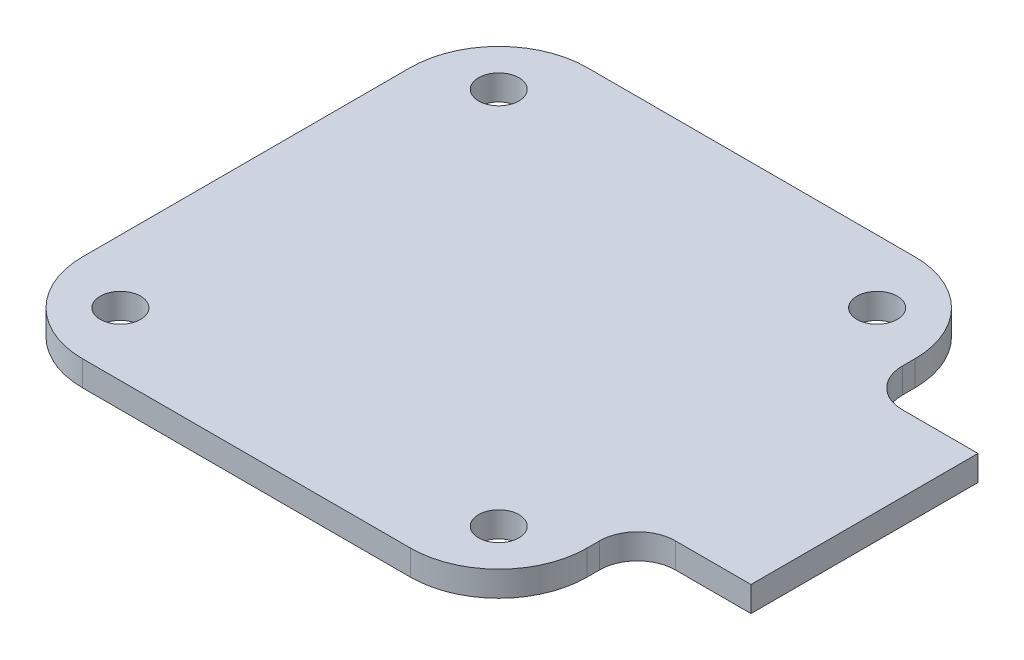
ISO-10303-21;
HEADER;
FILE_DESCRIPTION(('STEP AP214'),'2;1');
FILE_NAME('part.step','',(''),(''),'','','');
FILE_SCHEMA(('AUTOMOTIVE_DESIGN { 1 0 10303 214 1 1 1 1 }'));
ENDSEC;
DATA;
#1=APPLICATION_CONTEXT('core data for automotive mechanical design processes');
#2=APPLICATION_PROTOCOL_DEFINITION('international standard','automotive_design',2000,#1);
#3=PRODUCT_CONTEXT('',#1,'mechanical');
#4=PRODUCT('Part','Part','',(#3));
#5=PRODUCT_RELATED_PRODUCT_CATEGORY('part','',(#4));
#6=PRODUCT_DEFINITION_FORMATION('','',#4);
#7=PRODUCT_DEFINITION_CONTEXT('part definition',#1,'design');
#8=PRODUCT_DEFINITION('design','',#6,#7);
#9=PRODUCT_DEFINITION_SHAPE('','',#8);
#10=(LENGTH_UNIT() NAMED_UNIT(*) SI_UNIT(.MILLI.,.METRE.));
#11=(NAMED_UNIT(*) PLANE_ANGLE_UNIT() SI_UNIT($,.RADIAN.));
#12=(NAMED_UNIT(*) SI_UNIT($,.STERADIAN.) SOLID_ANGLE_UNIT());
#13=UNCERTAINTY_MEASURE_WITH_UNIT(LENGTH_MEASURE(1.E-05),#10,'distance_accuracy_value','');
#14=(GEOMETRIC_REPRESENTATION_CONTEXT(3) GLOBAL_UNCERTAINTY_ASSIGNED_CONTEXT((#13)) GLOBAL_UNIT_ASSIGNED_CONTEXT((#10,
#11,#12)) REPRESENTATION_CONTEXT('',''));
#15=CARTESIAN_POINT('',(0.,0.,0.));
#16=DIRECTION('',(0.,0.,1.));
#17=DIRECTION('',(1.,0.,0.));
#18=AXIS2_PLACEMENT_3D('',#15,#16,#17);
#19=CARTESIAN_POINT('',(-17.3708117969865,2.,-12.6206309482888));
#20=DIRECTION('',(0.,-1.,0.));
#21=DIRECTION('',(0.,0.,-1.));
#22=AXIS2_PLACEMENT_3D('',#19,#20,#21);
#23=CYLINDRICAL_SURFACE('',#22,7.);
#24=CARTESIAN_POINT('',(-17.3708117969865,0.,-12.6206309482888));
#25=DIRECTION('',(0.,1.,0.));
#26=DIRECTION('',(0.,0.,1.));
#27=AXIS2_PLACEMENT_3D('',#24,#25,#26);
#28=CIRCLE('',#27,7.);
#29=CARTESIAN_POINT('',(-17.3708117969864,0.,-19.6206309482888));
#30=VERTEX_POINT('',#29);
#31=CARTESIAN_POINT('',(-24.3708117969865,0.,-12.6206309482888));
#32=VERTEX_POINT('',#31);
#33=EDGE_CURVE('E170',#30,#32,#28,.T.);
#34=ORIENTED_EDGE('',*,*,#33,.T.);
#35=DIRECTION('',(0.,-1.,0.));
#36=VECTOR('',#35,1.);
#37=CARTESIAN_POINT('',(-24.3708117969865,2.,-12.6206309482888));
#38=LINE('',#37,#36);
#39=CARTESIAN_POINT('',(-24.3708117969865,2.,-12.6206309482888));
#40=VERTEX_POINT('',#39);
#41=EDGE_CURVE('E11',#40,#32,#38,.T.);
#42=ORIENTED_EDGE('',*,*,#41,.F.);
#43=CARTESIAN_POINT('',(-17.3708117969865,2.,-12.6206309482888));
#44=DIRECTION('',(0.,1.,0.));
#45=DIRECTION('',(0.,0.,1.));
#46=AXIS2_PLACEMENT_3D('',#43,#44,#45);
#47=CIRCLE('',#46,7.);
#48=CARTESIAN_POINT('',(-17.3708117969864,2.,-19.6206309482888));
#49=VERTEX_POINT('',#48);
#50=EDGE_CURVE('E197',#49,#40,#47,.T.);
#51=ORIENTED_EDGE('',*,*,#50,.F.);
#52=DIRECTION('',(0.,-1.,0.));
#53=VECTOR('',#52,1.);
#54=CARTESIAN_POINT('',(-17.3708117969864,2.,-19.6206309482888));
#55=LINE('',#54,#53);
#56=EDGE_CURVE('E166',#49,#30,#55,.T.);
#57=ORIENTED_EDGE('',*,*,#56,.T.);
#58=EDGE_LOOP('',(#34,#42,#51,#57));
#59=FACE_BOUND('',#58,.T.);
#60=ADVANCED_FACE('F38',(#59),#23,.T.);
#61=CARTESIAN_POINT('',(-24.3708117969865,2.,-12.6206309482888));
#62=DIRECTION('',(1.,0.,0.));
#63=DIRECTION('',(0.,0.,-1.));
#64=AXIS2_PLACEMENT_3D('',#61,#62,#63);
#65=PLANE('',#64);
#66=DIRECTION('',(0.,0.,1.));
#67=VECTOR('',#66,1.);
#68=CARTESIAN_POINT('',(-24.3708117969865,0.,-12.6206309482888));
#69=LINE('',#68,#67);
#70=CARTESIAN_POINT('',(-24.3708117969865,0.,13.3793690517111));
#71=VERTEX_POINT('',#70);
#72=EDGE_CURVE('E173',#32,#71,#69,.T.);
#73=ORIENTED_EDGE('',*,*,#72,.T.);
#74=DIRECTION('',(0.,-1.,0.));
#75=VECTOR('',#74,1.);
#76=CARTESIAN_POINT('',(-24.3708117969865,2.,13.3793690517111));
#77=LINE('',#76,#75);
#78=CARTESIAN_POINT('',(-24.3708117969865,2.,13.3793690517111));
#79=VERTEX_POINT('',#78);
#80=EDGE_CURVE('E46',#79,#71,#77,.T.);
#81=ORIENTED_EDGE('',*,*,#80,.F.);
#82=DIRECTION('',(0.,0.,1.));
#83=VECTOR('',#82,1.);
#84=CARTESIAN_POINT('',(-24.3708117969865,2.,-12.6206309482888));
#85=LINE('',#84,#83);
#86=EDGE_CURVE('E115',#40,#79,#85,.T.);
#87=ORIENTED_EDGE('',*,*,#86,.F.);
#88=ORIENTED_EDGE('',*,*,#41,.T.);
#89=EDGE_LOOP('',(#73,#81,#87,#88));
#90=FACE_BOUND('',#89,.T.);
#91=ADVANCED_FACE('F286',(#90),#65,.F.);
#92=CARTESIAN_POINT('',(-17.3708117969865,2.,13.3793690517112));
#93=DIRECTION('',(0.,-1.,0.));
#94=DIRECTION('',(0.,0.,-1.));
#95=AXIS2_PLACEMENT_3D('',#92,#93,#94);
#96=CYLINDRICAL_SURFACE('',#95,7.);
#97=CARTESIAN_POINT('',(-17.3708117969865,0.,13.3793690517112));
#98=DIRECTION('',(0.,1.,0.));
#99=DIRECTION('',(0.,0.,1.));
#100=AXIS2_PLACEMENT_3D('',#97,#98,#99);
#101=CIRCLE('',#100,7.);
#102=CARTESIAN_POINT('',(-17.3708117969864,0.,20.3793690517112));
#103=VERTEX_POINT('',#102);
#104=EDGE_CURVE('E176',#71,#103,#101,.T.);
#105=ORIENTED_EDGE('',*,*,#104,.T.);
#106=DIRECTION('',(0.,-1.,0.));
#107=VECTOR('',#106,1.);
#108=CARTESIAN_POINT('',(-17.3708117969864,2.,20.3793690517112));
#109=LINE('',#108,#107);
#110=CARTESIAN_POINT('',(-17.3708117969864,2.,20.3793690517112));
#111=VERTEX_POINT('',#110);
#112=EDGE_CURVE('E222',#111,#103,#109,.T.);
#113=ORIENTED_EDGE('',*,*,#112,.F.);
#114=CARTESIAN_POINT('',(-17.3708117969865,2.,13.3793690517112));
#115=DIRECTION('',(0.,1.,0.));
#116=DIRECTION('',(0.,0.,1.));
#117=AXIS2_PLACEMENT_3D('',#114,#115,#116);
#118=CIRCLE('',#117,7.);
#119=EDGE_CURVE('E230',#79,#111,#118,.T.);
#120=ORIENTED_EDGE('',*,*,#119,.F.);
#121=ORIENTED_EDGE('',*,*,#80,.T.);
#122=EDGE_LOOP('',(#105,#113,#120,#121));
#123=FACE_BOUND('',#122,.T.);
#124=ADVANCED_FACE('F228',(#123),#96,.T.);
#125=CARTESIAN_POINT('',(-17.3708117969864,2.,20.3793690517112));
#126=DIRECTION('',(0.,0.,-1.));
#127=DIRECTION('',(-1.,0.,0.));
#128=AXIS2_PLACEMENT_3D('',#125,#126,#127);
#129=PLANE('',#128);
#130=DIRECTION('',(1.,0.,0.));
#131=VECTOR('',#130,1.);
#132=CARTESIAN_POINT('',(-17.3708117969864,0.,20.3793690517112));
#133=LINE('',#132,#131);
#134=CARTESIAN_POINT('',(8.62918820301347,0.,20.3793690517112));
#135=VERTEX_POINT('',#134);
#136=EDGE_CURVE('E178',#103,#135,#133,.T.);
#137=ORIENTED_EDGE('',*,*,#136,.T.);
#138=DIRECTION('',(0.,-1.,0.));
#139=VECTOR('',#138,1.);
#140=CARTESIAN_POINT('',(8.62918820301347,2.,20.3793690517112));
#141=LINE('',#140,#139);
#142=CARTESIAN_POINT('',(8.62918820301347,2.,20.3793690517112));
#143=VERTEX_POINT('',#142);
#144=EDGE_CURVE('E219',#143,#135,#141,.T.);
#145=ORIENTED_EDGE('',*,*,#144,.F.);
#146=DIRECTION('',(1.,0.,0.));
#147=VECTOR('',#146,1.);
#148=CARTESIAN_POINT('',(-17.3708117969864,2.,20.3793690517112));
#149=LINE('',#148,#147);
#150=EDGE_CURVE('E248',#111,#143,#149,.T.);
#151=ORIENTED_EDGE('',*,*,#150,.F.);
#152=ORIENTED_EDGE('',*,*,#112,.T.);
#153=EDGE_LOOP('',(#137,#145,#151,#152));
#154=FACE_BOUND('',#153,.T.);
#155=ADVANCED_FACE('F239',(#154),#129,.F.);
#156=CARTESIAN_POINT('',(8.62918820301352,2.,13.3793690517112));
#157=DIRECTION('',(0.,-1.,0.));
#158=DIRECTION('',(0.,0.,-1.));
#159=AXIS2_PLACEMENT_3D('',#156,#157,#158);
#160=CYLINDRICAL_SURFACE('',#159,7.);
#161=CARTESIAN_POINT('',(8.62918820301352,0.,13.3793690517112));
#162=DIRECTION('',(0.,1.,0.));
#163=DIRECTION('',(0.,0.,-1.));
#164=AXIS2_PLACEMENT_3D('',#161,#162,#163);
#165=CIRCLE('',#164,7.);
#166=CARTESIAN_POINT('',(15.6291882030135,0.,13.3793690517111));
#167=VERTEX_POINT('',#166);
#168=EDGE_CURVE('E180',#135,#167,#165,.T.);
#169=ORIENTED_EDGE('',*,*,#168,.T.);
#170=DIRECTION('',(0.,-1.,0.));
#171=VECTOR('',#170,1.);
#172=CARTESIAN_POINT('',(15.6291882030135,2.,13.3793690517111));
#173=LINE('',#172,#171);
#174=CARTESIAN_POINT('',(15.6291882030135,2.,13.3793690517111));
#175=VERTEX_POINT('',#174);
#176=EDGE_CURVE('E216',#175,#167,#173,.T.);
#177=ORIENTED_EDGE('',*,*,#176,.F.);
#178=CARTESIAN_POINT('',(8.62918820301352,2.,13.3793690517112));
#179=DIRECTION('',(0.,1.,0.));
#180=DIRECTION('',(0.,0.,-1.));
#181=AXIS2_PLACEMENT_3D('',#178,#179,#180);
#182=CIRCLE('',#181,7.);
#183=EDGE_CURVE('E245',#143,#175,#182,.T.);
#184=ORIENTED_EDGE('',*,*,#183,.F.);
#185=ORIENTED_EDGE('',*,*,#144,.T.);
#186=EDGE_LOOP('',(#169,#177,#184,#185));
#187=FACE_BOUND('',#186,.T.);
#188=ADVANCED_FACE('F243',(#187),#160,.T.);
#189=CARTESIAN_POINT('',(15.6291882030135,2.,13.3793690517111));
#190=DIRECTION('',(-1.,0.,0.));
#191=DIRECTION('',(0.,0.,1.));
#192=AXIS2_PLACEMENT_3D('',#189,#190,#191);
#193=PLANE('',#192);
#194=DIRECTION('',(0.,0.,-1.));
#195=VECTOR('',#194,1.);
#196=CARTESIAN_POINT('',(15.6291882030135,0.,13.3793690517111));
#197=LINE('',#196,#195);
#198=CARTESIAN_POINT('',(15.6291882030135,0.,12.3793690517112));
#199=VERTEX_POINT('',#198);
#200=EDGE_CURVE('E182',#167,#199,#197,.T.);
#201=ORIENTED_EDGE('',*,*,#200,.T.);
#202=DIRECTION('',(0.,-1.,0.));
#203=VECTOR('',#202,1.);
#204=CARTESIAN_POINT('',(15.6291882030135,2.,12.3793690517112));
#205=LINE('',#204,#203);
#206=CARTESIAN_POINT('',(15.6291882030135,2.,12.3793690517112));
#207=VERTEX_POINT('',#206);
#208=EDGE_CURVE('E213',#207,#199,#205,.T.);
#209=ORIENTED_EDGE('',*,*,#208,.F.);
#210=DIRECTION('',(0.,0.,-1.));
#211=VECTOR('',#210,1.);
#212=CARTESIAN_POINT('',(15.6291882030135,2.,13.3793690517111));
#213=LINE('',#212,#211);
#214=EDGE_CURVE('E247',#175,#207,#213,.T.);
#215=ORIENTED_EDGE('',*,*,#214,.F.);
#216=ORIENTED_EDGE('',*,*,#176,.T.);
#217=EDGE_LOOP('',(#201,#209,#215,#216));
#218=FACE_BOUND('',#217,.T.);
#219=ADVANCED_FACE('F299',(#218),#193,.F.);
#220=CARTESIAN_POINT('',(18.6291882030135,2.,12.3793690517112));
#221=DIRECTION('',(0.,-1.,0.));
#222=DIRECTION('',(0.,0.,-1.));
#223=AXIS2_PLACEMENT_3D('',#220,#221,#222);
#224=CYLINDRICAL_SURFACE('',#223,3.);
#225=CARTESIAN_POINT('',(18.6291882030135,0.,12.3793690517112));
#226=DIRECTION('',(0.,-1.,0.));
#227=DIRECTION('',(0.,0.,-1.));
#228=AXIS2_PLACEMENT_3D('',#225,#226,#227);
#229=CIRCLE('',#228,3.);
#230=CARTESIAN_POINT('',(18.6291882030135,0.,9.37936905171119));
#231=VERTEX_POINT('',#230);
#232=EDGE_CURVE('E184',#199,#231,#229,.T.);
#233=ORIENTED_EDGE('',*,*,#232,.T.);
#234=DIRECTION('',(0.,-1.,0.));
#235=VECTOR('',#234,1.);
#236=CARTESIAN_POINT('',(18.6291882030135,2.,9.37936905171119));
#237=LINE('',#236,#235);
#238=CARTESIAN_POINT('',(18.6291882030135,2.,9.37936905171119));
#239=VERTEX_POINT('',#238);
#240=EDGE_CURVE('E210',#239,#231,#237,.T.);
#241=ORIENTED_EDGE('',*,*,#240,.F.);
#242=CARTESIAN_POINT('',(18.6291882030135,2.,12.3793690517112));
#243=DIRECTION('',(0.,-1.,0.));
#244=DIRECTION('',(0.,0.,-1.));
#245=AXIS2_PLACEMENT_3D('',#242,#243,#244);
#246=CIRCLE('',#245,3.);
#247=EDGE_CURVE('E250',#207,#239,#246,.T.);
#248=ORIENTED_EDGE('',*,*,#247,.F.);
#249=ORIENTED_EDGE('',*,*,#208,.T.);
#250=EDGE_LOOP('',(#233,#241,#248,#249));
#251=FACE_BOUND('',#250,.T.);
#252=ADVANCED_FACE('F302',(#251),#224,.F.);
#253=CARTESIAN_POINT('',(18.6291882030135,2.,9.37936905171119));
#254=DIRECTION('',(0.,0.,-1.));
#255=DIRECTION('',(-1.,0.,0.));
#256=AXIS2_PLACEMENT_3D('',#253,#254,#255);
#257=PLANE('',#256);
#258=DIRECTION('',(1.,0.,0.));
#259=VECTOR('',#258,1.);
#260=CARTESIAN_POINT('',(18.6291882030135,0.,9.37936905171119));
#261=LINE('',#260,#259);
#262=CARTESIAN_POINT('',(24.6291882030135,0.,9.37936905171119));
#263=VERTEX_POINT('',#262);
#264=EDGE_CURVE('E186',#231,#263,#261,.T.);
#265=ORIENTED_EDGE('',*,*,#264,.T.);
#266=DIRECTION('',(0.,-1.,0.));
#267=VECTOR('',#266,1.);
#268=CARTESIAN_POINT('',(24.6291882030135,2.,9.37936905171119));
#269=LINE('',#268,#267);
#270=CARTESIAN_POINT('',(24.6291882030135,2.,9.37936905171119));
#271=VERTEX_POINT('',#270);
#272=EDGE_CURVE('E207',#271,#263,#269,.T.);
#273=ORIENTED_EDGE('',*,*,#272,.F.);
#274=DIRECTION('',(1.,0.,0.));
#275=VECTOR('',#274,1.);
#276=CARTESIAN_POINT('',(18.6291882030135,2.,9.37936905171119));
#277=LINE('',#276,#275);
#278=EDGE_CURVE('E256',#239,#271,#277,.T.);
#279=ORIENTED_EDGE('',*,*,#278,.F.);
#280=ORIENTED_EDGE('',*,*,#240,.T.);
#281=EDGE_LOOP('',(#265,#273,#279,#280));
#282=FACE_BOUND('',#281,.T.);
#283=ADVANCED_FACE('F306',(#282),#257,.F.);
#284=CARTESIAN_POINT('',(24.6291882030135,2.,9.37936905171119));
#285=DIRECTION('',(-1.,0.,0.));
#286=DIRECTION('',(0.,0.,1.));
#287=AXIS2_PLACEMENT_3D('',#284,#285,#286);
#288=PLANE('',#287);
#289=DIRECTION('',(0.,0.,-1.));
#290=VECTOR('',#289,1.);
#291=CARTESIAN_POINT('',(24.6291882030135,0.,9.37936905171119));
#292=LINE('',#291,#290);
#293=CARTESIAN_POINT('',(24.6291882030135,0.,-8.62063094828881));
#294=VERTEX_POINT('',#293);
#295=EDGE_CURVE('E188',#263,#294,#292,.T.);
#296=ORIENTED_EDGE('',*,*,#295,.T.);
#297=DIRECTION('',(0.,-1.,0.));
#298=VECTOR('',#297,1.);
#299=CARTESIAN_POINT('',(24.6291882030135,2.,-8.62063094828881));
#300=LINE('',#299,#298);
#301=CARTESIAN_POINT('',(24.6291882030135,2.,-8.62063094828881));
#302=VERTEX_POINT('',#301);
#303=EDGE_CURVE('E204',#302,#294,#300,.T.);
#304=ORIENTED_EDGE('',*,*,#303,.F.);
#305=DIRECTION('',(0.,0.,-1.));
#306=VECTOR('',#305,1.);
#307=CARTESIAN_POINT('',(24.6291882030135,2.,9.37936905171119));
#308=LINE('',#307,#306);
#309=EDGE_CURVE('E258',#271,#302,#308,.T.);
#310=ORIENTED_EDGE('',*,*,#309,.F.);
#311=ORIENTED_EDGE('',*,*,#272,.T.);
#312=EDGE_LOOP('',(#296,#304,#310,#311));
#313=FACE_BOUND('',#312,.T.);
#314=ADVANCED_FACE('F310',(#313),#288,.F.);
#315=CARTESIAN_POINT('',(24.6291882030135,2.,-8.62063094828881));
#316=DIRECTION('',(0.,0.,1.));
#317=DIRECTION('',(1.,0.,0.));
#318=AXIS2_PLACEMENT_3D('',#315,#316,#317);
#319=PLANE('',#318);
#320=DIRECTION('',(-1.,0.,0.));
#321=VECTOR('',#320,1.);
#322=CARTESIAN_POINT('',(24.6291882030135,0.,-8.62063094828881));
#323=LINE('',#322,#321);
#324=CARTESIAN_POINT('',(18.6291882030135,0.,-8.62063094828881));
#325=VERTEX_POINT('',#324);
#326=EDGE_CURVE('E190',#294,#325,#323,.T.);
#327=ORIENTED_EDGE('',*,*,#326,.T.);
#328=DIRECTION('',(0.,-1.,0.));
#329=VECTOR('',#328,1.);
#330=CARTESIAN_POINT('',(18.6291882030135,2.,-8.62063094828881));
#331=LINE('',#330,#329);
#332=CARTESIAN_POINT('',(18.6291882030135,2.,-8.62063094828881));
#333=VERTEX_POINT('',#332);
#334=EDGE_CURVE('E201',#333,#325,#331,.T.);
#335=ORIENTED_EDGE('',*,*,#334,.F.);
#336=DIRECTION('',(-1.,0.,0.));
#337=VECTOR('',#336,1.);
#338=CARTESIAN_POINT('',(24.6291882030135,2.,-8.62063094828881));
#339=LINE('',#338,#337);
#340=EDGE_CURVE('E260',#302,#333,#339,.T.);
#341=ORIENTED_EDGE('',*,*,#340,.F.);
#342=ORIENTED_EDGE('',*,*,#303,.T.);
#343=EDGE_LOOP('',(#327,#335,#341,#342));
#344=FACE_BOUND('',#343,.T.);
#345=ADVANCED_FACE('F266',(#344),#319,.F.);
#346=CARTESIAN_POINT('',(18.6291882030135,2.,-11.6206309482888));
#347=DIRECTION('',(0.,-1.,0.));
#348=DIRECTION('',(0.,0.,-1.));
#349=AXIS2_PLACEMENT_3D('',#346,#347,#348);
#350=CYLINDRICAL_SURFACE('',#349,3.);
#351=CARTESIAN_POINT('',(18.6291882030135,0.,-11.6206309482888));
#352=DIRECTION('',(0.,-1.,0.));
#353=DIRECTION('',(0.,0.,1.));
#354=AXIS2_PLACEMENT_3D('',#351,#352,#353);
#355=CIRCLE('',#354,3.);
#356=CARTESIAN_POINT('',(15.6291882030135,0.,-11.6206309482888));
#357=VERTEX_POINT('',#356);
#358=EDGE_CURVE('E192',#325,#357,#355,.T.);
#359=ORIENTED_EDGE('',*,*,#358,.T.);
#360=DIRECTION('',(0.,-1.,0.));
#361=VECTOR('',#360,1.);
#362=CARTESIAN_POINT('',(15.6291882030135,2.,-11.6206309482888));
#363=LINE('',#362,#361);
#364=CARTESIAN_POINT('',(15.6291882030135,2.,-11.6206309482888));
#365=VERTEX_POINT('',#364);
#366=EDGE_CURVE('E161',#365,#357,#363,.T.);
#367=ORIENTED_EDGE('',*,*,#366,.F.);
#368=CARTESIAN_POINT('',(18.6291882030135,2.,-11.6206309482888));
#369=DIRECTION('',(0.,-1.,0.));
#370=DIRECTION('',(0.,0.,1.));
#371=AXIS2_PLACEMENT_3D('',#368,#369,#370);
#372=CIRCLE('',#371,3.);
#373=EDGE_CURVE('E152',#333,#365,#372,.T.);
#374=ORIENTED_EDGE('',*,*,#373,.F.);
#375=ORIENTED_EDGE('',*,*,#334,.T.);
#376=EDGE_LOOP('',(#359,#367,#374,#375));
#377=FACE_BOUND('',#376,.T.);
#378=ADVANCED_FACE('F270',(#377),#350,.F.);
#379=CARTESIAN_POINT('',(15.6291882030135,2.,-11.6206309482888));
#380=DIRECTION('',(-1.,0.,0.));
#381=DIRECTION('',(0.,0.,1.));
#382=AXIS2_PLACEMENT_3D('',#379,#380,#381);
#383=PLANE('',#382);
#384=DIRECTION('',(0.,0.,-1.));
#385=VECTOR('',#384,1.);
#386=CARTESIAN_POINT('',(15.6291882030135,0.,-11.6206309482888));
#387=LINE('',#386,#385);
#388=CARTESIAN_POINT('',(15.6291882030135,0.,-12.6206309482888));
#389=VERTEX_POINT('',#388);
#390=EDGE_CURVE('E160',#357,#389,#387,.T.);
#391=ORIENTED_EDGE('',*,*,#390,.T.);
#392=DIRECTION('',(0.,-1.,0.));
#393=VECTOR('',#392,1.);
#394=CARTESIAN_POINT('',(15.6291882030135,2.,-12.6206309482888));
#395=LINE('',#394,#393);
#396=CARTESIAN_POINT('',(15.6291882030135,2.,-12.6206309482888));
#397=VERTEX_POINT('',#396);
#398=EDGE_CURVE('E157',#397,#389,#395,.T.);
#399=ORIENTED_EDGE('',*,*,#398,.F.);
#400=DIRECTION('',(0.,0.,-1.));
#401=VECTOR('',#400,1.);
#402=CARTESIAN_POINT('',(15.6291882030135,2.,-11.6206309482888));
#403=LINE('',#402,#401);
#404=EDGE_CURVE('E146',#365,#397,#403,.T.);
#405=ORIENTED_EDGE('',*,*,#404,.F.);
#406=ORIENTED_EDGE('',*,*,#366,.T.);
#407=EDGE_LOOP('',(#391,#399,#405,#406));
#408=FACE_BOUND('',#407,.T.);
#409=ADVANCED_FACE('F158',(#408),#383,.F.);
#410=CARTESIAN_POINT('',(8.62918820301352,2.,-12.6206309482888));
#411=DIRECTION('',(0.,-1.,0.));
#412=DIRECTION('',(0.,0.,-1.));
#413=AXIS2_PLACEMENT_3D('',#410,#411,#412);
#414=CYLINDRICAL_SURFACE('',#413,7.);
#415=CARTESIAN_POINT('',(8.62918820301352,0.,-12.6206309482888));
#416=DIRECTION('',(0.,1.,0.));
#417=DIRECTION('',(0.,0.,1.));
#418=AXIS2_PLACEMENT_3D('',#415,#416,#417);
#419=CIRCLE('',#418,7.);
#420=CARTESIAN_POINT('',(8.62918820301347,0.,-19.6206309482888));
#421=VERTEX_POINT('',#420);
#422=EDGE_CURVE('E101',#389,#421,#419,.T.);
#423=ORIENTED_EDGE('',*,*,#422,.T.);
#424=DIRECTION('',(0.,-1.,0.));
#425=VECTOR('',#424,1.);
#426=CARTESIAN_POINT('',(8.62918820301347,2.,-19.6206309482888));
#427=LINE('',#426,#425);
#428=CARTESIAN_POINT('',(8.62918820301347,2.,-19.6206309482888));
#429=VERTEX_POINT('',#428);
#430=EDGE_CURVE('E162',#429,#421,#427,.T.);
#431=ORIENTED_EDGE('',*,*,#430,.F.);
#432=CARTESIAN_POINT('',(8.62918820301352,2.,-12.6206309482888));
#433=DIRECTION('',(0.,1.,0.));
#434=DIRECTION('',(0.,0.,1.));
#435=AXIS2_PLACEMENT_3D('',#432,#433,#434);
#436=CIRCLE('',#435,7.);
#437=EDGE_CURVE('E150',#397,#429,#436,.T.);
#438=ORIENTED_EDGE('',*,*,#437,.F.);
#439=ORIENTED_EDGE('',*,*,#398,.T.);
#440=EDGE_LOOP('',(#423,#431,#438,#439));
#441=FACE_BOUND('',#440,.T.);
#442=ADVANCED_FACE('F164',(#441),#414,.T.);
#443=CARTESIAN_POINT('',(-17.3708117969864,2.,-19.6206309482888));
#444=DIRECTION('',(0.,0.,1.));
#445=DIRECTION('',(1.,0.,0.));
#446=AXIS2_PLACEMENT_3D('',#443,#444,#445);
#447=PLANE('',#446);
#448=DIRECTION('',(-1.,0.,0.));
#449=VECTOR('',#448,1.);
#450=CARTESIAN_POINT('',(-17.3708117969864,0.,-19.6206309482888));
#451=LINE('',#450,#449);
#452=EDGE_CURVE('E107',#421,#30,#451,.T.);
#453=ORIENTED_EDGE('',*,*,#452,.T.);
#454=ORIENTED_EDGE('',*,*,#56,.F.);
#455=DIRECTION('',(-1.,0.,0.));
#456=VECTOR('',#455,1.);
#457=CARTESIAN_POINT('',(-17.3708117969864,2.,-19.6206309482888));
#458=LINE('',#457,#456);
#459=EDGE_CURVE('E54',#429,#49,#458,.T.);
#460=ORIENTED_EDGE('',*,*,#459,.F.);
#461=ORIENTED_EDGE('',*,*,#430,.T.);
#462=EDGE_LOOP('',(#453,#454,#460,#461));
#463=FACE_BOUND('',#462,.T.);
#464=ADVANCED_FACE('F274',(#463),#447,.F.);
#465=CARTESIAN_POINT('',(-17.3708117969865,2.,-12.6206309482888));
#466=DIRECTION('',(0.,1.,0.));
#467=DIRECTION('',(0.,0.,1.));
#468=AXIS2_PLACEMENT_3D('',#465,#466,#467);
#469=PLANE('',#468);
#470=CARTESIAN_POINT('',(-19.3708117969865,2.,15.3793690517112));
#471=DIRECTION('',(0.,1.,0.));
#472=DIRECTION('',(0.,0.,1.));
#473=AXIS2_PLACEMENT_3D('',#470,#471,#472);
#474=CIRCLE('',#473,1.6);
#475=CARTESIAN_POINT('',(-19.3708117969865,2.,16.9793690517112));
#476=VERTEX_POINT('',#475);
#477=EDGE_CURVE('E174',#476,#476,#474,.T.);
#478=ORIENTED_EDGE('',*,*,#477,.F.);
#479=EDGE_LOOP('',(#478));
#480=FACE_BOUND('',#479,.T.);
#481=CARTESIAN_POINT('',(10.6291882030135,2.,-14.6206309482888));
#482=DIRECTION('',(0.,1.,0.));
#483=DIRECTION('',(0.,0.,1.));
#484=AXIS2_PLACEMENT_3D('',#481,#482,#483);
#485=CIRCLE('',#484,1.6);
#486=CARTESIAN_POINT('',(10.6291882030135,2.,-13.0206309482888));
#487=VERTEX_POINT('',#486);
#488=EDGE_CURVE('E413',#487,#487,#485,.T.);
#489=ORIENTED_EDGE('',*,*,#488,.F.);
#490=EDGE_LOOP('',(#489));
#491=FACE_BOUND('',#490,.T.);
#492=CARTESIAN_POINT('',(10.6291882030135,2.,15.3793690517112));
#493=DIRECTION('',(0.,1.,0.));
#494=DIRECTION('',(0.,0.,1.));
#495=AXIS2_PLACEMENT_3D('',#492,#493,#494);
#496=CIRCLE('',#495,1.6);
#497=CARTESIAN_POINT('',(10.6291882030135,2.,16.9793690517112));
#498=VERTEX_POINT('',#497);
#499=EDGE_CURVE('E410',#498,#498,#496,.T.);
#500=ORIENTED_EDGE('',*,*,#499,.F.);
#501=EDGE_LOOP('',(#500));
#502=FACE_BOUND('',#501,.T.);
#503=CARTESIAN_POINT('',(-19.3708117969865,2.,-14.6206309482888));
#504=DIRECTION('',(0.,1.,0.));
#505=DIRECTION('',(0.,0.,1.));
#506=AXIS2_PLACEMENT_3D('',#503,#504,#505);
#507=CIRCLE('',#506,1.6);
#508=CARTESIAN_POINT('',(-19.3708117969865,2.,-13.0206309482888));
#509=VERTEX_POINT('',#508);
#510=EDGE_CURVE('E401',#509,#509,#507,.T.);
#511=ORIENTED_EDGE('',*,*,#510,.F.);
#512=EDGE_LOOP('',(#511));
#513=FACE_BOUND('',#512,.T.);
#514=ORIENTED_EDGE('',*,*,#50,.T.);
#515=ORIENTED_EDGE('',*,*,#86,.T.);
#516=ORIENTED_EDGE('',*,*,#119,.T.);
#517=ORIENTED_EDGE('',*,*,#150,.T.);
#518=ORIENTED_EDGE('',*,*,#183,.T.);
#519=ORIENTED_EDGE('',*,*,#214,.T.);
#520=ORIENTED_EDGE('',*,*,#247,.T.);
#521=ORIENTED_EDGE('',*,*,#278,.T.);
#522=ORIENTED_EDGE('',*,*,#309,.T.);
#523=ORIENTED_EDGE('',*,*,#340,.T.);
#524=ORIENTED_EDGE('',*,*,#373,.T.);
#525=ORIENTED_EDGE('',*,*,#404,.T.);
#526=ORIENTED_EDGE('',*,*,#437,.T.);
#527=ORIENTED_EDGE('',*,*,#459,.T.);
#528=EDGE_LOOP('',(#514,#515,#516,#517,#518,#519,#520,#521,#522,#523,#524,#525,#526,#527));
#529=FACE_BOUND('',#528,.T.);
#530=ADVANCED_FACE('F148',(#480,#491,#502,#513,#529),#469,.T.);
#531=CARTESIAN_POINT('',(-17.3708117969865,0.,-12.6206309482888));
#532=DIRECTION('',(0.,1.,0.));
#533=DIRECTION('',(0.,0.,1.));
#534=AXIS2_PLACEMENT_3D('',#531,#532,#533);
#535=PLANE('',#534);
#536=CARTESIAN_POINT('',(-19.3708117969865,0.,15.3793690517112));
#537=DIRECTION('',(0.,-1.,0.));
#538=DIRECTION('',(0.,0.,-1.));
#539=AXIS2_PLACEMENT_3D('',#536,#537,#538);
#540=CIRCLE('',#539,1.6);
#541=CARTESIAN_POINT('',(-19.3708117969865,0.,13.7793690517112));
#542=VERTEX_POINT('',#541);
#543=EDGE_CURVE('E396',#542,#542,#540,.T.);
#544=ORIENTED_EDGE('',*,*,#543,.F.);
#545=EDGE_LOOP('',(#544));
#546=FACE_BOUND('',#545,.T.);
#547=CARTESIAN_POINT('',(10.6291882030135,0.,-14.6206309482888));
#548=DIRECTION('',(0.,-1.,0.));
#549=DIRECTION('',(0.,0.,-1.));
#550=AXIS2_PLACEMENT_3D('',#547,#548,#549);
#551=CIRCLE('',#550,1.6);
#552=CARTESIAN_POINT('',(10.6291882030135,0.,-16.2206309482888));
#553=VERTEX_POINT('',#552);
#554=EDGE_CURVE('E398',#553,#553,#551,.T.);
#555=ORIENTED_EDGE('',*,*,#554,.F.);
#556=EDGE_LOOP('',(#555));
#557=FACE_BOUND('',#556,.T.);
#558=CARTESIAN_POINT('',(10.6291882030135,0.,15.3793690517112));
#559=DIRECTION('',(0.,-1.,0.));
#560=DIRECTION('',(0.,0.,-1.));
#561=AXIS2_PLACEMENT_3D('',#558,#559,#560);
#562=CIRCLE('',#561,1.6);
#563=CARTESIAN_POINT('',(10.6291882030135,0.,13.7793690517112));
#564=VERTEX_POINT('',#563);
#565=EDGE_CURVE('E404',#564,#564,#562,.T.);
#566=ORIENTED_EDGE('',*,*,#565,.F.);
#567=EDGE_LOOP('',(#566));
#568=FACE_BOUND('',#567,.T.);
#569=CARTESIAN_POINT('',(-19.3708117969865,0.,-14.6206309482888));
#570=DIRECTION('',(0.,-1.,0.));
#571=DIRECTION('',(0.,0.,-1.));
#572=AXIS2_PLACEMENT_3D('',#569,#570,#571);
#573=CIRCLE('',#572,1.6);
#574=CARTESIAN_POINT('',(-19.3708117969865,0.,-16.2206309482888));
#575=VERTEX_POINT('',#574);
#576=EDGE_CURVE('E397',#575,#575,#573,.T.);
#577=ORIENTED_EDGE('',*,*,#576,.F.);
#578=EDGE_LOOP('',(#577));
#579=FACE_BOUND('',#578,.T.);
#580=ORIENTED_EDGE('',*,*,#33,.F.);
#581=ORIENTED_EDGE('',*,*,#452,.F.);
#582=ORIENTED_EDGE('',*,*,#422,.F.);
#583=ORIENTED_EDGE('',*,*,#390,.F.);
#584=ORIENTED_EDGE('',*,*,#358,.F.);
#585=ORIENTED_EDGE('',*,*,#326,.F.);
#586=ORIENTED_EDGE('',*,*,#295,.F.);
#587=ORIENTED_EDGE('',*,*,#264,.F.);
#588=ORIENTED_EDGE('',*,*,#232,.F.);
#589=ORIENTED_EDGE('',*,*,#200,.F.);
#590=ORIENTED_EDGE('',*,*,#168,.F.);
#591=ORIENTED_EDGE('',*,*,#136,.F.);
#592=ORIENTED_EDGE('',*,*,#104,.F.);
#593=ORIENTED_EDGE('',*,*,#72,.F.);
#594=EDGE_LOOP('',(#580,#581,#582,#583,#584,#585,#586,#587,#588,#589,#590,#591,#592,#593));
#595=FACE_BOUND('',#594,.T.);
#596=ADVANCED_FACE('F234',(#546,#557,#568,#579,#595),#535,.F.);
#597=CARTESIAN_POINT('',(-19.3708117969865,10.,-14.6206309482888));
#598=DIRECTION('',(0.,-1.,0.));
#599=DIRECTION('',(0.,0.,-1.));
#600=AXIS2_PLACEMENT_3D('',#597,#598,#599);
#601=CYLINDRICAL_SURFACE('',#600,1.6);
#602=ORIENTED_EDGE('',*,*,#510,.T.);
#603=EDGE_LOOP('',(#602));
#604=FACE_BOUND('',#603,.T.);
#605=ORIENTED_EDGE('',*,*,#576,.T.);
#606=EDGE_LOOP('',(#605));
#607=FACE_BOUND('',#606,.T.);
#608=ADVANCED_FACE('F348',(#604,#607),#601,.F.);
#609=CARTESIAN_POINT('',(10.6291882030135,10.,15.3793690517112));
#610=DIRECTION('',(0.,-1.,0.));
#611=DIRECTION('',(0.,0.,-1.));
#612=AXIS2_PLACEMENT_3D('',#609,#610,#611);
#613=CYLINDRICAL_SURFACE('',#612,1.6);
#614=ORIENTED_EDGE('',*,*,#499,.T.);
#615=EDGE_LOOP('',(#614));
#616=FACE_BOUND('',#615,.T.);
#617=ORIENTED_EDGE('',*,*,#565,.T.);
#618=EDGE_LOOP('',(#617));
#619=FACE_BOUND('',#618,.T.);
#620=ADVANCED_FACE('F357',(#616,#619),#613,.F.);
#621=CARTESIAN_POINT('',(10.6291882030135,10.,-14.6206309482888));
#622=DIRECTION('',(0.,-1.,0.));
#623=DIRECTION('',(0.,0.,-1.));
#624=AXIS2_PLACEMENT_3D('',#621,#622,#623);
#625=CYLINDRICAL_SURFACE('',#624,1.6);
#626=ORIENTED_EDGE('',*,*,#488,.T.);
#627=EDGE_LOOP('',(#626));
#628=FACE_BOUND('',#627,.T.);
#629=ORIENTED_EDGE('',*,*,#554,.T.);
#630=EDGE_LOOP('',(#629));
#631=FACE_BOUND('',#630,.T.);
#632=ADVANCED_FACE('F367',(#628,#631),#625,.F.);
#633=CARTESIAN_POINT('',(-19.3708117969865,10.,15.3793690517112));
#634=DIRECTION('',(0.,-1.,0.));
#635=DIRECTION('',(0.,0.,-1.));
#636=AXIS2_PLACEMENT_3D('',#633,#634,#635);
#637=CYLINDRICAL_SURFACE('',#636,1.6);
#638=ORIENTED_EDGE('',*,*,#477,.T.);
#639=EDGE_LOOP('',(#638));
#640=FACE_BOUND('',#639,.T.);
#641=ORIENTED_EDGE('',*,*,#543,.T.);
#642=EDGE_LOOP('',(#641));
#643=FACE_BOUND('',#642,.T.);
#644=ADVANCED_FACE('F377',(#640,#643),#637,.F.);
#645=CLOSED_SHELL('',(#60,#91,#124,#155,#188,#219,#252,#283,#314,#345,#378,#409,#442,#464,#530,
#596,#608,#620,#632,#644));
#646=MANIFOLD_SOLID_BREP('B2',#645);
#647=ADVANCED_BREP_SHAPE_REPRESENTATION('',(#18,#646),#14);
#648=SHAPE_DEFINITION_REPRESENTATION(#9,#647);
ENDSEC;
END-ISO-10303-21;
